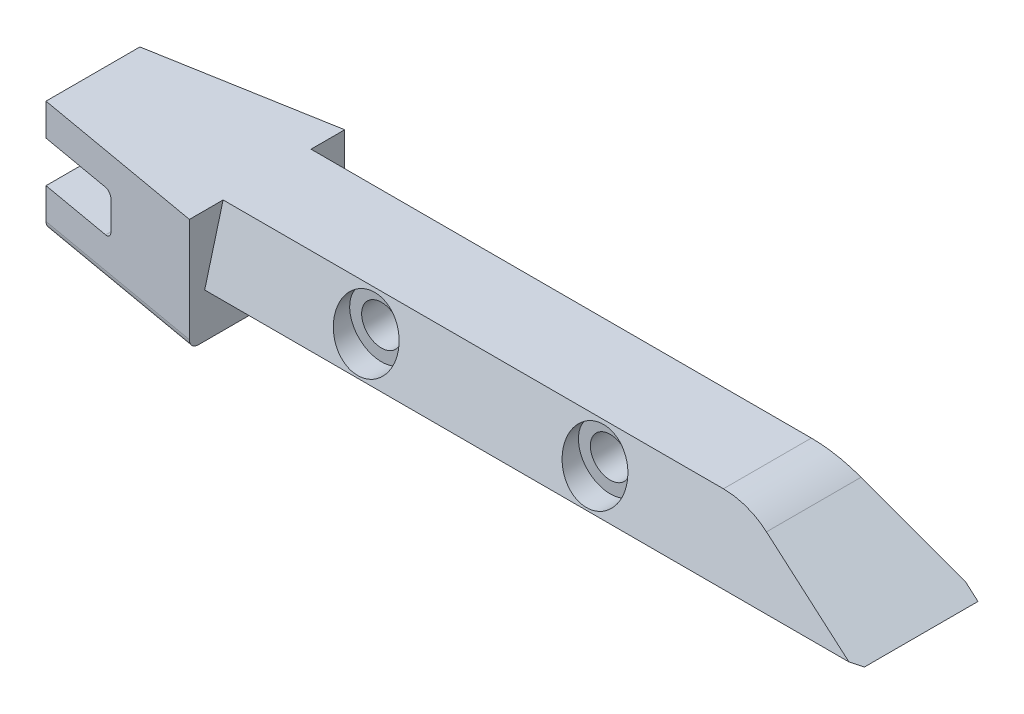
ISO-10303-21;
HEADER;
FILE_DESCRIPTION(('STEP AP214'),'2;1');
FILE_NAME('part.step','',(''),(''),'','','');
FILE_SCHEMA(('AUTOMOTIVE_DESIGN { 1 0 10303 214 1 1 1 1 }'));
ENDSEC;
DATA;
#1=APPLICATION_CONTEXT('core data for automotive mechanical design processes');
#2=APPLICATION_PROTOCOL_DEFINITION('international standard','automotive_design',2000,#1);
#3=PRODUCT_CONTEXT('',#1,'mechanical');
#4=PRODUCT('Part','Part','',(#3));
#5=PRODUCT_RELATED_PRODUCT_CATEGORY('part','',(#4));
#6=PRODUCT_DEFINITION_FORMATION('','',#4);
#7=PRODUCT_DEFINITION_CONTEXT('part definition',#1,'design');
#8=PRODUCT_DEFINITION('design','',#6,#7);
#9=PRODUCT_DEFINITION_SHAPE('','',#8);
#10=(LENGTH_UNIT() NAMED_UNIT(*) SI_UNIT(.MILLI.,.METRE.));
#11=(NAMED_UNIT(*) PLANE_ANGLE_UNIT() SI_UNIT($,.RADIAN.));
#12=(NAMED_UNIT(*) SI_UNIT($,.STERADIAN.) SOLID_ANGLE_UNIT());
#13=UNCERTAINTY_MEASURE_WITH_UNIT(LENGTH_MEASURE(1.E-05),#10,'distance_accuracy_value','');
#14=(GEOMETRIC_REPRESENTATION_CONTEXT(3) GLOBAL_UNCERTAINTY_ASSIGNED_CONTEXT((#13)) GLOBAL_UNIT_ASSIGNED_CONTEXT((#10,
#11,#12)) REPRESENTATION_CONTEXT('',''));
#15=CARTESIAN_POINT('',(0.,0.,0.));
#16=DIRECTION('',(0.,0.,1.));
#17=DIRECTION('',(1.,0.,0.));
#18=AXIS2_PLACEMENT_3D('',#15,#16,#17);
#19=CARTESIAN_POINT('',(38.1,3.81,-7.7597));
#20=DIRECTION('',(0.,0.,1.));
#21=DIRECTION('',(1.,0.,0.));
#22=AXIS2_PLACEMENT_3D('',#19,#20,#21);
#23=CYLINDRICAL_SURFACE('',#22,1.9812);
#24=CARTESIAN_POINT('',(38.1,3.81,-3.81));
#25=DIRECTION('',(0.,0.,1.));
#26=DIRECTION('',(1.,0.,0.));
#27=AXIS2_PLACEMENT_3D('',#24,#25,#26);
#28=CIRCLE('',#27,1.9812);
#29=CARTESIAN_POINT('',(40.0812,3.81,-3.81));
#30=VERTEX_POINT('',#29);
#31=EDGE_CURVE('E382',#30,#30,#28,.F.);
#32=ORIENTED_EDGE('',*,*,#31,.T.);
#33=EDGE_LOOP('',(#32));
#34=FACE_BOUND('',#33,.T.);
#35=CARTESIAN_POINT('',(38.1,3.81,3.81));
#36=DIRECTION('',(0.,0.,1.));
#37=DIRECTION('',(1.,0.,0.));
#38=AXIS2_PLACEMENT_3D('',#35,#36,#37);
#39=CIRCLE('',#38,1.9812);
#40=CARTESIAN_POINT('',(40.0812,3.81,3.81));
#41=VERTEX_POINT('',#40);
#42=EDGE_CURVE('E392',#41,#41,#39,.F.);
#43=ORIENTED_EDGE('',*,*,#42,.F.);
#44=EDGE_LOOP('',(#43));
#45=FACE_BOUND('',#44,.T.);
#46=ADVANCED_FACE('F34',(#34,#45),#23,.F.);
#47=CARTESIAN_POINT('',(15.24,3.81,-7.7597));
#48=DIRECTION('',(0.,0.,1.));
#49=DIRECTION('',(1.,0.,0.));
#50=AXIS2_PLACEMENT_3D('',#47,#48,#49);
#51=CYLINDRICAL_SURFACE('',#50,1.9812);
#52=CARTESIAN_POINT('',(15.24,3.81,-3.81));
#53=DIRECTION('',(0.,0.,1.));
#54=DIRECTION('',(1.,0.,0.));
#55=AXIS2_PLACEMENT_3D('',#52,#53,#54);
#56=CIRCLE('',#55,1.9812);
#57=CARTESIAN_POINT('',(17.2212,3.81,-3.81));
#58=VERTEX_POINT('',#57);
#59=EDGE_CURVE('E379',#58,#58,#56,.F.);
#60=ORIENTED_EDGE('',*,*,#59,.T.);
#61=EDGE_LOOP('',(#60));
#62=FACE_BOUND('',#61,.T.);
#63=CARTESIAN_POINT('',(15.24,3.81,3.81));
#64=DIRECTION('',(0.,0.,1.));
#65=DIRECTION('',(1.,0.,0.));
#66=AXIS2_PLACEMENT_3D('',#63,#64,#65);
#67=CIRCLE('',#66,1.9812);
#68=CARTESIAN_POINT('',(17.2212,3.81,3.81));
#69=VERTEX_POINT('',#68);
#70=EDGE_CURVE('E389',#69,#69,#67,.F.);
#71=ORIENTED_EDGE('',*,*,#70,.F.);
#72=EDGE_LOOP('',(#71));
#73=FACE_BOUND('',#72,.T.);
#74=ADVANCED_FACE('F513',(#62,#73),#51,.F.);
#75=CARTESIAN_POINT('',(-17.399,-3.9878,4.6917868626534));
#76=DIRECTION('',(-1.,0.,0.));
#77=DIRECTION('',(0.,0.,1.));
#78=AXIS2_PLACEMENT_3D('',#75,#76,#77);
#79=PLANE('',#78);
#80=DIRECTION('',(0.,0.,-1.));
#81=VECTOR('',#80,1.);
#82=CARTESIAN_POINT('',(-17.399,4.1148,4.6917868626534));
#83=LINE('',#82,#81);
#84=CARTESIAN_POINT('',(-17.399,4.1148,4.6917868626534));
#85=VERTEX_POINT('',#84);
#86=CARTESIAN_POINT('',(-17.399,4.1148,-4.6917868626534));
#87=VERTEX_POINT('',#86);
#88=EDGE_CURVE('E370',#85,#87,#83,.T.);
#89=ORIENTED_EDGE('',*,*,#88,.F.);
#90=DIRECTION('',(0.,1.,0.));
#91=VECTOR('',#90,1.);
#92=CARTESIAN_POINT('',(-17.399,-3.9878,4.6917868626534));
#93=LINE('',#92,#91);
#94=CARTESIAN_POINT('',(-17.399,7.3152,4.6917868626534));
#95=VERTEX_POINT('',#94);
#96=EDGE_CURVE('E301',#85,#95,#93,.T.);
#97=ORIENTED_EDGE('',*,*,#96,.T.);
#98=DIRECTION('',(0.,0.,1.));
#99=VECTOR('',#98,1.);
#100=CARTESIAN_POINT('',(-17.399,7.3152,4.6917868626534));
#101=LINE('',#100,#99);
#102=CARTESIAN_POINT('',(-17.399,7.3152,-4.6917868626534));
#103=VERTEX_POINT('',#102);
#104=EDGE_CURVE('E428',#103,#95,#101,.T.);
#105=ORIENTED_EDGE('',*,*,#104,.F.);
#106=DIRECTION('',(0.,1.,0.));
#107=VECTOR('',#106,1.);
#108=CARTESIAN_POINT('',(-17.399,-3.9878,-4.6917868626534));
#109=LINE('',#108,#107);
#110=EDGE_CURVE('E284',#87,#103,#109,.T.);
#111=ORIENTED_EDGE('',*,*,#110,.F.);
#112=EDGE_LOOP('',(#89,#97,#105,#111));
#113=FACE_BOUND('',#112,.T.);
#114=ADVANCED_FACE('F519',(#113),#79,.T.);
#115=CARTESIAN_POINT('',(65.151,0.,6.35213681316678));
#116=DIRECTION('',(0.,1.,0.));
#117=DIRECTION('',(0.,0.,1.));
#118=AXIS2_PLACEMENT_3D('',#115,#116,#117);
#119=PLANE('',#118);
#120=DIRECTION('',(-1.,0.,0.));
#121=VECTOR('',#120,1.);
#122=CARTESIAN_POINT('',(65.151,0.,5.46313681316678));
#123=LINE('',#122,#121);
#124=CARTESIAN_POINT('',(65.151,0.,5.46313681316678));
#125=VERTEX_POINT('',#124);
#126=CARTESIAN_POINT('',(0.254000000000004,0.,5.46313681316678));
#127=VERTEX_POINT('',#126);
#128=EDGE_CURVE('E346',#125,#127,#123,.T.);
#129=ORIENTED_EDGE('',*,*,#128,.T.);
#130=DIRECTION('',(0.,0.,-1.));
#131=VECTOR('',#130,1.);
#132=CARTESIAN_POINT('',(0.254000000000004,0.,6.35213681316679));
#133=LINE('',#132,#131);
#134=CARTESIAN_POINT('',(0.254000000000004,0.,-5.89195655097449));
#135=VERTEX_POINT('',#134);
#136=EDGE_CURVE('E357',#127,#135,#133,.T.);
#137=ORIENTED_EDGE('',*,*,#136,.T.);
#138=DIRECTION('',(1.,0.,0.));
#139=VECTOR('',#138,1.);
#140=CARTESIAN_POINT('',(65.151,0.,-5.89195655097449));
#141=LINE('',#140,#139);
#142=CARTESIAN_POINT('',(65.151,0.,-5.89195655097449));
#143=VERTEX_POINT('',#142);
#144=EDGE_CURVE('E349',#135,#143,#141,.T.);
#145=ORIENTED_EDGE('',*,*,#144,.T.);
#146=DIRECTION('',(0.,0.,-1.));
#147=VECTOR('',#146,1.);
#148=CARTESIAN_POINT('',(65.151,0.,6.35213681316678));
#149=LINE('',#148,#147);
#150=EDGE_CURVE('E320',#125,#143,#149,.T.);
#151=ORIENTED_EDGE('',*,*,#150,.F.);
#152=EDGE_LOOP('',(#129,#137,#145,#151));
#153=FACE_BOUND('',#152,.T.);
#154=ADVANCED_FACE('F555',(#153),#119,.F.);
#155=CARTESIAN_POINT('',(65.151,0.,-6.35213681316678));
#156=DIRECTION('',(0.,-0.258819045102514,0.96592582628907));
#157=DIRECTION('',(0.,-0.96592582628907,-0.258819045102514));
#158=AXIS2_PLACEMENT_3D('',#155,#156,#157);
#159=PLANE('',#158);
#160=DIRECTION('',(-1.,0.,0.));
#161=VECTOR('',#160,1.);
#162=CARTESIAN_POINT('',(65.151,0.858708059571,-6.12204668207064));
#163=LINE('',#162,#161);
#164=CARTESIAN_POINT('',(36.929316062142,0.858708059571,-6.12204668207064));
#165=VERTEX_POINT('',#164);
#166=CARTESIAN_POINT('',(16.4106839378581,0.858708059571,-6.12204668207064));
#167=VERTEX_POINT('',#166);
#168=EDGE_CURVE('E342',#165,#167,#163,.T.);
#169=ORIENTED_EDGE('',*,*,#168,.T.);
#170=CARTESIAN_POINT('',(15.24,3.81,-5.33125039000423));
#171=DIRECTION('',(0.,-0.258819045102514,0.96592582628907));
#172=DIRECTION('',(0.,0.96592582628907,0.258819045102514));
#173=AXIS2_PLACEMENT_3D('',#170,#171,#172);
#174=ELLIPSE('',#173,3.28700187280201,3.175);
#175=CARTESIAN_POINT('',(14.069316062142,0.858708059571,-6.12204668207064));
#176=VERTEX_POINT('',#175);
#177=EDGE_CURVE('E446',#167,#176,#174,.T.);
#178=ORIENTED_EDGE('',*,*,#177,.T.);
#179=CARTESIAN_POINT('',(0.,0.858708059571,-6.12204668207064));
#180=VERTEX_POINT('',#179);
#181=EDGE_CURVE('E337',#176,#180,#163,.T.);
#182=ORIENTED_EDGE('',*,*,#181,.T.);
#183=DIRECTION('',(0.,0.96592582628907,0.258819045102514));
#184=VECTOR('',#183,1.);
#185=CARTESIAN_POINT('',(0.,0.,-6.35213681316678));
#186=LINE('',#185,#184);
#187=CARTESIAN_POINT('',(0.,7.3152,-4.39203488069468));
#188=VERTEX_POINT('',#187);
#189=EDGE_CURVE('E319',#180,#188,#186,.T.);
#190=ORIENTED_EDGE('',*,*,#189,.T.);
#191=DIRECTION('',(-1.,0.,0.));
#192=VECTOR('',#191,1.);
#193=CARTESIAN_POINT('',(65.151,7.3152,-4.39203488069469));
#194=LINE('',#193,#192);
#195=CARTESIAN_POINT('',(49.9965449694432,7.3152,-4.39203488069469));
#196=VERTEX_POINT('',#195);
#197=EDGE_CURVE('E331',#196,#188,#194,.T.);
#198=ORIENTED_EDGE('',*,*,#197,.F.);
#199=CARTESIAN_POINT('',(49.9965449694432,-1.9558,-6.87619184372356));
#200=DIRECTION('',(0.,-0.258819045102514,0.96592582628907));
#201=DIRECTION('',(0.,0.96592582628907,0.258819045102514));
#202=AXIS2_PLACEMENT_3D('',#199,#200,#201);
#203=ELLIPSE('',#202,9.59804546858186,9.271);
#204=CARTESIAN_POINT('',(54.6320449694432,6.07312151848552,-4.72484880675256));
#205=VERTEX_POINT('',#204);
#206=EDGE_CURVE('E316',#196,#205,#203,.F.);
#207=ORIENTED_EDGE('',*,*,#206,.T.);
#208=DIRECTION('',(0.858356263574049,-0.495572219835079,-0.132788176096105));
#209=VECTOR('',#208,1.);
#210=CARTESIAN_POINT('',(65.151,0.,-6.35213681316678));
#211=LINE('',#210,#209);
#212=CARTESIAN_POINT('',(63.6636740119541,0.858708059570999,-6.12204668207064));
#213=VERTEX_POINT('',#212);
#214=EDGE_CURVE('E313',#205,#213,#211,.T.);
#215=ORIENTED_EDGE('',*,*,#214,.T.);
#216=CARTESIAN_POINT('',(39.270683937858,0.858708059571,-6.12204668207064));
#217=VERTEX_POINT('',#216);
#218=EDGE_CURVE('E338',#213,#217,#163,.T.);
#219=ORIENTED_EDGE('',*,*,#218,.T.);
#220=CARTESIAN_POINT('',(38.1,3.81,-5.33125039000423));
#221=DIRECTION('',(0.,-0.258819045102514,0.96592582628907));
#222=DIRECTION('',(0.,0.96592582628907,0.258819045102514));
#223=AXIS2_PLACEMENT_3D('',#220,#221,#222);
#224=ELLIPSE('',#223,3.287001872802,3.175);
#225=EDGE_CURVE('E386',#217,#165,#224,.T.);
#226=ORIENTED_EDGE('',*,*,#225,.T.);
#227=EDGE_LOOP('',(#169,#178,#182,#190,#198,#207,#215,#219,#226));
#228=FACE_BOUND('',#227,.T.);
#229=ADVANCED_FACE('F443',(#228),#159,.F.);
#230=CARTESIAN_POINT('',(65.151,7.3152,4.39203488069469));
#231=DIRECTION('',(0.,-1.,0.));
#232=DIRECTION('',(0.,0.,-1.));
#233=AXIS2_PLACEMENT_3D('',#230,#231,#232);
#234=PLANE('',#233);
#235=ORIENTED_EDGE('',*,*,#197,.T.);
#236=DIRECTION('',(0.,0.,-1.));
#237=VECTOR('',#236,1.);
#238=CARTESIAN_POINT('',(0.,7.3152,7.7597));
#239=LINE('',#238,#237);
#240=CARTESIAN_POINT('',(0.,7.3152,-7.7597));
#241=VERTEX_POINT('',#240);
#242=EDGE_CURVE('E421',#188,#241,#239,.T.);
#243=ORIENTED_EDGE('',*,*,#242,.T.);
#244=DIRECTION('',(-0.984807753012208,0.,0.173648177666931));
#245=VECTOR('',#244,1.);
#246=CARTESIAN_POINT('',(0.,7.3152,-7.7597));
#247=LINE('',#246,#245);
#248=EDGE_CURVE('E278',#241,#103,#247,.T.);
#249=ORIENTED_EDGE('',*,*,#248,.T.);
#250=ORIENTED_EDGE('',*,*,#104,.T.);
#251=DIRECTION('',(0.984807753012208,0.,0.173648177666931));
#252=VECTOR('',#251,1.);
#253=CARTESIAN_POINT('',(0.,7.3152,7.7597));
#254=LINE('',#253,#252);
#255=CARTESIAN_POINT('',(0.,7.3152,7.7597));
#256=VERTEX_POINT('',#255);
#257=EDGE_CURVE('E431',#95,#256,#254,.T.);
#258=ORIENTED_EDGE('',*,*,#257,.T.);
#259=CARTESIAN_POINT('',(0.,7.3152,4.39203488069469));
#260=VERTEX_POINT('',#259);
#261=EDGE_CURVE('E418',#256,#260,#239,.T.);
#262=ORIENTED_EDGE('',*,*,#261,.T.);
#263=DIRECTION('',(-1.,0.,0.));
#264=VECTOR('',#263,1.);
#265=CARTESIAN_POINT('',(65.151,7.3152,4.39203488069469));
#266=LINE('',#265,#264);
#267=CARTESIAN_POINT('',(49.9965449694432,7.3152,4.39203488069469));
#268=VERTEX_POINT('',#267);
#269=EDGE_CURVE('E323',#268,#260,#266,.T.);
#270=ORIENTED_EDGE('',*,*,#269,.F.);
#271=DIRECTION('',(0.,0.,1.));
#272=VECTOR('',#271,1.);
#273=CARTESIAN_POINT('',(49.9965449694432,7.3152,-6.35213681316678));
#274=LINE('',#273,#272);
#275=EDGE_CURVE('E279',#196,#268,#274,.T.);
#276=ORIENTED_EDGE('',*,*,#275,.F.);
#277=EDGE_LOOP('',(#235,#243,#249,#250,#258,#262,#270,#276));
#278=FACE_BOUND('',#277,.T.);
#279=ADVANCED_FACE('F436',(#278),#234,.F.);
#280=CARTESIAN_POINT('',(65.151,0.,6.35213681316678));
#281=DIRECTION('',(0.,-0.258819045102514,-0.96592582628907));
#282=DIRECTION('',(0.,0.96592582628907,-0.258819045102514));
#283=AXIS2_PLACEMENT_3D('',#280,#281,#282);
#284=PLANE('',#283);
#285=CARTESIAN_POINT('',(15.24,3.81,5.33125039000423));
#286=DIRECTION('',(0.,-0.258819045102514,-0.96592582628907));
#287=DIRECTION('',(0.,0.96592582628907,-0.258819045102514));
#288=AXIS2_PLACEMENT_3D('',#285,#286,#287);
#289=ELLIPSE('',#288,3.28700187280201,3.175);
#290=CARTESIAN_POINT('',(15.24,6.985,4.48051170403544));
#291=VERTEX_POINT('',#290);
#292=EDGE_CURVE('E399',#291,#291,#289,.F.);
#293=ORIENTED_EDGE('',*,*,#292,.F.);
#294=EDGE_LOOP('',(#293));
#295=FACE_BOUND('',#294,.T.);
#296=CARTESIAN_POINT('',(38.1,3.81,5.33125039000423));
#297=DIRECTION('',(0.,-0.258819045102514,-0.96592582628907));
#298=DIRECTION('',(0.,0.96592582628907,-0.258819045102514));
#299=AXIS2_PLACEMENT_3D('',#296,#297,#298);
#300=ELLIPSE('',#299,3.287001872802,3.175);
#301=CARTESIAN_POINT('',(38.1,6.985,4.48051170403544));
#302=VERTEX_POINT('',#301);
#303=EDGE_CURVE('E396',#302,#302,#300,.F.);
#304=ORIENTED_EDGE('',*,*,#303,.F.);
#305=EDGE_LOOP('',(#304));
#306=FACE_BOUND('',#305,.T.);
#307=DIRECTION('',(0.,-0.96592582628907,0.258819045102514));
#308=VECTOR('',#307,1.);
#309=CARTESIAN_POINT('',(0.,0.,6.35213681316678));
#310=LINE('',#309,#308);
#311=CARTESIAN_POINT('',(0.,0.4445,6.23303339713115));
#312=VERTEX_POINT('',#311);
#313=EDGE_CURVE('E324',#260,#312,#310,.T.);
#314=ORIENTED_EDGE('',*,*,#313,.T.);
#315=DIRECTION('',(1.,0.,0.));
#316=VECTOR('',#315,1.);
#317=CARTESIAN_POINT('',(65.151,0.4445,6.23303339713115));
#318=LINE('',#317,#316);
#319=CARTESIAN_POINT('',(64.3811034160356,0.444500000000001,6.23303339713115));
#320=VERTEX_POINT('',#319);
#321=EDGE_CURVE('E355',#312,#320,#318,.T.);
#322=ORIENTED_EDGE('',*,*,#321,.T.);
#323=DIRECTION('',(-0.858356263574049,0.495572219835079,-0.132788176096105));
#324=VECTOR('',#323,1.);
#325=CARTESIAN_POINT('',(65.151,0.,6.35213681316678));
#326=LINE('',#325,#324);
#327=CARTESIAN_POINT('',(54.6320449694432,6.07312151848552,4.72484880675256));
#328=VERTEX_POINT('',#327);
#329=EDGE_CURVE('E310',#320,#328,#326,.T.);
#330=ORIENTED_EDGE('',*,*,#329,.T.);
#331=CARTESIAN_POINT('',(49.9965449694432,-1.9558,6.87619184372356));
#332=DIRECTION('',(0.,-0.258819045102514,-0.96592582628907));
#333=DIRECTION('',(0.,-0.96592582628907,0.258819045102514));
#334=AXIS2_PLACEMENT_3D('',#331,#332,#333);
#335=ELLIPSE('',#334,9.59804546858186,9.271);
#336=EDGE_CURVE('E334',#328,#268,#335,.F.);
#337=ORIENTED_EDGE('',*,*,#336,.T.);
#338=ORIENTED_EDGE('',*,*,#269,.T.);
#339=EDGE_LOOP('',(#314,#322,#330,#337,#338));
#340=FACE_BOUND('',#339,.T.);
#341=ADVANCED_FACE('F625',(#295,#306,#340),#284,.F.);
#342=CARTESIAN_POINT('',(49.9965449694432,-1.9558,-6.35213681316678));
#343=DIRECTION('',(0.,0.,1.));
#344=DIRECTION('',(1.,0.,0.));
#345=AXIS2_PLACEMENT_3D('',#342,#343,#344);
#346=CYLINDRICAL_SURFACE('',#345,9.271);
#347=ORIENTED_EDGE('',*,*,#275,.T.);
#348=ORIENTED_EDGE('',*,*,#336,.F.);
#349=DIRECTION('',(0.,0.,1.));
#350=VECTOR('',#349,1.);
#351=CARTESIAN_POINT('',(54.6320449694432,6.07312151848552,-6.35213681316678));
#352=LINE('',#351,#350);
#353=EDGE_CURVE('E307',#205,#328,#352,.T.);
#354=ORIENTED_EDGE('',*,*,#353,.F.);
#355=ORIENTED_EDGE('',*,*,#206,.F.);
#356=EDGE_LOOP('',(#347,#348,#354,#355));
#357=FACE_BOUND('',#356,.T.);
#358=ADVANCED_FACE('F630',(#357),#346,.T.);
#359=CARTESIAN_POINT('',(65.151,0.,-6.35213681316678));
#360=DIRECTION('',(-0.5,-0.866025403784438,0.));
#361=DIRECTION('',(0.866025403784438,-0.5,0.));
#362=AXIS2_PLACEMENT_3D('',#359,#360,#361);
#363=PLANE('',#362);
#364=ORIENTED_EDGE('',*,*,#150,.T.);
#365=DIRECTION('',(0.858356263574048,-0.495572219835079,0.132788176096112));
#366=VECTOR('',#365,1.);
#367=CARTESIAN_POINT('',(64.7594993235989,0.226033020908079,-5.95252191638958));
#368=LINE('',#367,#366);
#369=EDGE_CURVE('E353',#143,#213,#368,.F.);
#370=ORIENTED_EDGE('',*,*,#369,.T.);
#371=ORIENTED_EDGE('',*,*,#214,.F.);
#372=ORIENTED_EDGE('',*,*,#353,.T.);
#373=ORIENTED_EDGE('',*,*,#329,.F.);
#374=DIRECTION('',(-0.654653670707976,0.377964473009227,0.654653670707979));
#375=VECTOR('',#374,1.);
#376=CARTESIAN_POINT('',(65.151,0.,5.46313681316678));
#377=LINE('',#376,#375);
#378=EDGE_CURVE('E351',#320,#125,#377,.F.);
#379=ORIENTED_EDGE('',*,*,#378,.T.);
#380=EDGE_LOOP('',(#364,#370,#371,#372,#373,#379));
#381=FACE_BOUND('',#380,.T.);
#382=ADVANCED_FACE('F569',(#381),#363,.F.);
#383=CARTESIAN_POINT('',(65.151,0.858708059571,-6.12204668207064));
#384=DIRECTION('',(0.,0.258819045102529,0.965925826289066));
#385=DIRECTION('',(-1.,0.,0.));
#386=AXIS2_PLACEMENT_3D('',#383,#384,#385);
#387=PLANE('',#386);
#388=CARTESIAN_POINT('',(15.24,3.81,-6.9128429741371));
#389=DIRECTION('',(0.,0.258819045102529,0.965925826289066));
#390=DIRECTION('',(0.,-0.965925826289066,0.258819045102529));
#391=AXIS2_PLACEMENT_3D('',#388,#389,#390);
#392=ELLIPSE('',#391,3.28700187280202,3.175);
#393=EDGE_CURVE('E224',#167,#176,#392,.F.);
#394=ORIENTED_EDGE('',*,*,#393,.F.);
#395=ORIENTED_EDGE('',*,*,#168,.F.);
#396=CARTESIAN_POINT('',(38.1,3.81,-6.9128429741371));
#397=DIRECTION('',(0.,0.258819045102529,0.965925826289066));
#398=DIRECTION('',(0.,-0.965925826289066,0.258819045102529));
#399=AXIS2_PLACEMENT_3D('',#396,#397,#398);
#400=ELLIPSE('',#399,3.28700187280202,3.175);
#401=EDGE_CURVE('E378',#217,#165,#400,.F.);
#402=ORIENTED_EDGE('',*,*,#401,.F.);
#403=ORIENTED_EDGE('',*,*,#218,.F.);
#404=ORIENTED_EDGE('',*,*,#369,.F.);
#405=ORIENTED_EDGE('',*,*,#144,.F.);
#406=CARTESIAN_POINT('',(0.254000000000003,-0.254000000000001,-5.82389745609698));
#407=DIRECTION('',(0.,0.258819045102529,0.965925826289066));
#408=DIRECTION('',(0.,0.965925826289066,-0.258819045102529));
#409=AXIS2_PLACEMENT_3D('',#406,#407,#408);
#410=ELLIPSE('',#409,0.262960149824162,0.254);
#411=CARTESIAN_POINT('',(0.,-0.254000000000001,-5.82389745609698));
#412=VERTEX_POINT('',#411);
#413=EDGE_CURVE('E363',#135,#412,#410,.T.);
#414=ORIENTED_EDGE('',*,*,#413,.T.);
#415=DIRECTION('',(0.,0.965925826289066,-0.258819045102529));
#416=VECTOR('',#415,1.);
#417=CARTESIAN_POINT('',(0.,0.858708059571,-6.12204668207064));
#418=LINE('',#417,#416);
#419=EDGE_CURVE('E344',#180,#412,#418,.F.);
#420=ORIENTED_EDGE('',*,*,#419,.F.);
#421=ORIENTED_EDGE('',*,*,#181,.F.);
#422=EDGE_LOOP('',(#394,#395,#402,#403,#404,#405,#414,#420,#421));
#423=FACE_BOUND('',#422,.T.);
#424=ADVANCED_FACE('F452',(#423),#387,.F.);
#425=CARTESIAN_POINT('',(65.151,0.,5.46313681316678));
#426=DIRECTION('',(0.,0.866025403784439,-0.499999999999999));
#427=DIRECTION('',(-1.,0.,0.));
#428=AXIS2_PLACEMENT_3D('',#425,#426,#427);
#429=PLANE('',#428);
#430=ORIENTED_EDGE('',*,*,#378,.F.);
#431=ORIENTED_EDGE('',*,*,#321,.F.);
#432=DIRECTION('',(0.,-0.499999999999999,-0.866025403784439));
#433=VECTOR('',#432,1.);
#434=CARTESIAN_POINT('',(0.,0.,5.46313681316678));
#435=LINE('',#434,#433);
#436=CARTESIAN_POINT('',(0.,-0.254000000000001,5.02319590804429));
#437=VERTEX_POINT('',#436);
#438=EDGE_CURVE('E341',#437,#312,#435,.F.);
#439=ORIENTED_EDGE('',*,*,#438,.F.);
#440=CARTESIAN_POINT('',(0.254000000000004,-0.254000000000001,5.02319590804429));
#441=DIRECTION('',(0.,0.866025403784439,-0.499999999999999));
#442=DIRECTION('',(0.,-0.499999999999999,-0.866025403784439));
#443=AXIS2_PLACEMENT_3D('',#440,#441,#442);
#444=ELLIPSE('',#443,0.508000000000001,0.254);
#445=EDGE_CURVE('E366',#437,#127,#444,.T.);
#446=ORIENTED_EDGE('',*,*,#445,.T.);
#447=ORIENTED_EDGE('',*,*,#128,.F.);
#448=EDGE_LOOP('',(#430,#431,#439,#446,#447));
#449=FACE_BOUND('',#448,.T.);
#450=ADVANCED_FACE('F568',(#449),#429,.F.);
#451=CARTESIAN_POINT('',(0.,-3.9878,7.7597));
#452=DIRECTION('',(1.,0.,0.));
#453=DIRECTION('',(0.,0.,-1.));
#454=AXIS2_PLACEMENT_3D('',#451,#452,#453);
#455=PLANE('',#454);
#456=DIRECTION('',(0.,0.,-1.));
#457=VECTOR('',#456,1.);
#458=CARTESIAN_POINT('',(0.,-3.9878,7.7597));
#459=LINE('',#458,#457);
#460=CARTESIAN_POINT('',(0.,-3.9878,6.85698574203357));
#461=VERTEX_POINT('',#460);
#462=CARTESIAN_POINT('',(0.,-3.9878,-6.85698574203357));
#463=VERTEX_POINT('',#462);
#464=EDGE_CURVE('E270',#461,#463,#459,.T.);
#465=ORIENTED_EDGE('',*,*,#464,.T.);
#466=CARTESIAN_POINT('',(0.,-3.0988,-6.85698574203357));
#467=DIRECTION('',(1.,0.,0.));
#468=DIRECTION('',(0.,0.,1.));
#469=AXIS2_PLACEMENT_3D('',#466,#467,#468);
#470=ELLIPSE('',#469,0.902714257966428,0.889);
#471=CARTESIAN_POINT('',(0.,-3.0988,-7.7597));
#472=VERTEX_POINT('',#471);
#473=EDGE_CURVE('E42',#463,#472,#470,.T.);
#474=ORIENTED_EDGE('',*,*,#473,.T.);
#475=DIRECTION('',(0.,1.,0.));
#476=VECTOR('',#475,1.);
#477=CARTESIAN_POINT('',(0.,-3.9878,-7.7597));
#478=LINE('',#477,#476);
#479=EDGE_CURVE('E267',#472,#241,#478,.T.);
#480=ORIENTED_EDGE('',*,*,#479,.T.);
#481=ORIENTED_EDGE('',*,*,#242,.F.);
#482=ORIENTED_EDGE('',*,*,#189,.F.);
#483=ORIENTED_EDGE('',*,*,#419,.T.);
#484=DIRECTION('',(0.,0.,-1.));
#485=VECTOR('',#484,1.);
#486=CARTESIAN_POINT('',(0.,-0.254000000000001,7.7597));
#487=LINE('',#486,#485);
#488=EDGE_CURVE('E360',#412,#437,#487,.F.);
#489=ORIENTED_EDGE('',*,*,#488,.T.);
#490=ORIENTED_EDGE('',*,*,#438,.T.);
#491=ORIENTED_EDGE('',*,*,#313,.F.);
#492=ORIENTED_EDGE('',*,*,#261,.F.);
#493=DIRECTION('',(0.,1.,0.));
#494=VECTOR('',#493,1.);
#495=CARTESIAN_POINT('',(0.,-3.9878,7.7597));
#496=LINE('',#495,#494);
#497=CARTESIAN_POINT('',(0.,-3.0988,7.7597));
#498=VERTEX_POINT('',#497);
#499=EDGE_CURVE('E280',#498,#256,#496,.T.);
#500=ORIENTED_EDGE('',*,*,#499,.F.);
#501=CARTESIAN_POINT('',(0.,-3.0988,6.85698574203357));
#502=DIRECTION('',(1.,0.,0.));
#503=DIRECTION('',(0.,0.,1.));
#504=AXIS2_PLACEMENT_3D('',#501,#502,#503);
#505=ELLIPSE('',#504,0.902714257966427,0.889);
#506=EDGE_CURVE('E49',#498,#461,#505,.T.);
#507=ORIENTED_EDGE('',*,*,#506,.T.);
#508=EDGE_LOOP('',(#465,#474,#480,#481,#482,#483,#489,#490,#491,#492,#500,#507));
#509=FACE_BOUND('',#508,.T.);
#510=ADVANCED_FACE('F266',(#509),#455,.T.);
#511=CARTESIAN_POINT('',(0.,-3.9878,-7.7597));
#512=DIRECTION('',(-0.173648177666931,0.,-0.984807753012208));
#513=DIRECTION('',(-0.984807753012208,0.,0.173648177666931));
#514=AXIS2_PLACEMENT_3D('',#511,#512,#513);
#515=PLANE('',#514);
#516=DIRECTION('',(0.701673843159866,0.701673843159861,-0.123724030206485));
#517=VECTOR('',#516,1.);
#518=CARTESIAN_POINT('',(-12.8756371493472,-2.63943714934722,-5.48937777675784));
#519=LINE('',#518,#517);
#520=CARTESIAN_POINT('',(-12.6492,-2.413,-5.52930475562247));
#521=VERTEX_POINT('',#520);
#522=CARTESIAN_POINT('',(-13.335,-3.0988,-5.4083797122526));
#523=VERTEX_POINT('',#522);
#524=EDGE_CURVE('E241',#521,#523,#519,.F.);
#525=ORIENTED_EDGE('',*,*,#524,.T.);
#526=DIRECTION('',(-0.984807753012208,0.,0.173648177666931));
#527=VECTOR('',#526,1.);
#528=CARTESIAN_POINT('',(0.,-3.0988,-7.7597));
#529=LINE('',#528,#527);
#530=CARTESIAN_POINT('',(-17.399,-3.0988,-4.6917868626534));
#531=VERTEX_POINT('',#530);
#532=EDGE_CURVE('E247',#523,#531,#529,.T.);
#533=ORIENTED_EDGE('',*,*,#532,.T.);
#534=CARTESIAN_POINT('',(-17.399,0.,-4.6917868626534));
#535=VERTEX_POINT('',#534);
#536=EDGE_CURVE('E304',#531,#535,#109,.T.);
#537=ORIENTED_EDGE('',*,*,#536,.T.);
#538=DIRECTION('',(-0.984807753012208,0.,0.173648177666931));
#539=VECTOR('',#538,1.);
#540=CARTESIAN_POINT('',(0.,0.,-7.7597));
#541=LINE('',#540,#539);
#542=CARTESIAN_POINT('',(-10.16,0.,-5.96821787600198));
#543=VERTEX_POINT('',#542);
#544=EDGE_CURVE('E473',#543,#535,#541,.T.);
#545=ORIENTED_EDGE('',*,*,#544,.F.);
#546=CARTESIAN_POINT('',(-10.16,0.634999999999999,-5.96821787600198));
#547=DIRECTION('',(-0.173648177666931,0.,-0.984807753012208));
#548=DIRECTION('',(-0.984807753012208,0.,0.173648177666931));
#549=AXIS2_PLACEMENT_3D('',#546,#547,#548);
#550=ELLIPSE('',#549,0.644795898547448,0.635);
#551=CARTESIAN_POINT('',(-9.525,0.635000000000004,-6.08018550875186));
#552=VERTEX_POINT('',#551);
#553=EDGE_CURVE('E480',#552,#543,#550,.T.);
#554=ORIENTED_EDGE('',*,*,#553,.F.);
#555=DIRECTION('',(0.,-1.,0.));
#556=VECTOR('',#555,1.);
#557=CARTESIAN_POINT('',(-9.525,-3.9878,-6.08018550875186));
#558=LINE('',#557,#556);
#559=CARTESIAN_POINT('',(-9.525,3.47979999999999,-6.08018550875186));
#560=VERTEX_POINT('',#559);
#561=EDGE_CURVE('E481',#560,#552,#558,.T.);
#562=ORIENTED_EDGE('',*,*,#561,.F.);
#563=CARTESIAN_POINT('',(-10.16,3.4798,-5.96821787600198));
#564=DIRECTION('',(-0.173648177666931,0.,-0.984807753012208));
#565=DIRECTION('',(-0.984807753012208,0.,0.173648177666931));
#566=AXIS2_PLACEMENT_3D('',#563,#564,#565);
#567=ELLIPSE('',#566,0.644795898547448,0.635);
#568=CARTESIAN_POINT('',(-10.16,4.1148,-5.96821787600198));
#569=VERTEX_POINT('',#568);
#570=EDGE_CURVE('E424',#569,#560,#567,.T.);
#571=ORIENTED_EDGE('',*,*,#570,.F.);
#572=DIRECTION('',(0.984807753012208,0.,-0.173648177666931));
#573=VECTOR('',#572,1.);
#574=CARTESIAN_POINT('',(0.,4.1148,-7.7597));
#575=LINE('',#574,#573);
#576=EDGE_CURVE('E478',#87,#569,#575,.T.);
#577=ORIENTED_EDGE('',*,*,#576,.F.);
#578=ORIENTED_EDGE('',*,*,#110,.T.);
#579=ORIENTED_EDGE('',*,*,#248,.F.);
#580=ORIENTED_EDGE('',*,*,#479,.F.);
#581=DIRECTION('',(-0.984807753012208,0.,0.173648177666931));
#582=VECTOR('',#581,1.);
#583=CARTESIAN_POINT('',(0.,-3.0988,-7.7597));
#584=LINE('',#583,#582);
#585=CARTESIAN_POINT('',(-8.76299999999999,-3.0988,-6.21454666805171));
#586=VERTEX_POINT('',#585);
#587=EDGE_CURVE('E244',#472,#586,#584,.T.);
#588=ORIENTED_EDGE('',*,*,#587,.T.);
#589=DIRECTION('',(0.701673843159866,-0.701673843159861,-0.123724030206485));
#590=VECTOR('',#589,1.);
#591=CARTESIAN_POINT('',(-9.72422770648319,-2.13757229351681,-6.04505628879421));
#592=LINE('',#591,#590);
#593=CARTESIAN_POINT('',(-9.44879999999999,-2.413,-6.09362162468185));
#594=VERTEX_POINT('',#593);
#595=EDGE_CURVE('E409',#586,#594,#592,.F.);
#596=ORIENTED_EDGE('',*,*,#595,.T.);
#597=DIRECTION('',(0.984807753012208,0.,-0.173648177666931));
#598=VECTOR('',#597,1.);
#599=CARTESIAN_POINT('',(0.,-2.413,-7.7597));
#600=LINE('',#599,#598);
#601=EDGE_CURVE('E223',#521,#594,#600,.T.);
#602=ORIENTED_EDGE('',*,*,#601,.F.);
#603=EDGE_LOOP('',(#525,#533,#537,#545,#554,#562,#571,#577,#578,#579,#580,#588,#596,#602));
#604=FACE_BOUND('',#603,.T.);
#605=ADVANCED_FACE('F276',(#604),#515,.T.);
#606=CARTESIAN_POINT('',(0.,-3.9878,7.7597));
#607=DIRECTION('',(-0.173648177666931,0.,0.984807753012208));
#608=DIRECTION('',(0.984807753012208,0.,0.173648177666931));
#609=AXIS2_PLACEMENT_3D('',#606,#607,#608);
#610=PLANE('',#609);
#611=CARTESIAN_POINT('',(-17.399,-3.0988,4.6917868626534));
#612=VERTEX_POINT('',#611);
#613=CARTESIAN_POINT('',(-17.399,0.,4.6917868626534));
#614=VERTEX_POINT('',#613);
#615=EDGE_CURVE('E293',#612,#614,#93,.T.);
#616=ORIENTED_EDGE('',*,*,#615,.F.);
#617=DIRECTION('',(0.984807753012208,0.,0.173648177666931));
#618=VECTOR('',#617,1.);
#619=CARTESIAN_POINT('',(0.,-3.0988,7.7597));
#620=LINE('',#619,#618);
#621=EDGE_CURVE('E11',#612,#498,#620,.T.);
#622=ORIENTED_EDGE('',*,*,#621,.T.);
#623=ORIENTED_EDGE('',*,*,#499,.T.);
#624=ORIENTED_EDGE('',*,*,#257,.F.);
#625=ORIENTED_EDGE('',*,*,#96,.F.);
#626=DIRECTION('',(-0.984807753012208,0.,-0.173648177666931));
#627=VECTOR('',#626,1.);
#628=CARTESIAN_POINT('',(0.,4.1148,7.7597));
#629=LINE('',#628,#627);
#630=CARTESIAN_POINT('',(-10.16,4.1148,5.96821787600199));
#631=VERTEX_POINT('',#630);
#632=EDGE_CURVE('E476',#631,#85,#629,.T.);
#633=ORIENTED_EDGE('',*,*,#632,.F.);
#634=CARTESIAN_POINT('',(-10.16,3.4798,5.96821787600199));
#635=DIRECTION('',(-0.173648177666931,0.,0.984807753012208));
#636=DIRECTION('',(0.984807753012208,0.,0.173648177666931));
#637=AXIS2_PLACEMENT_3D('',#634,#635,#636);
#638=ELLIPSE('',#637,0.644795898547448,0.635);
#639=CARTESIAN_POINT('',(-9.525,3.47979999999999,6.08018550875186));
#640=VERTEX_POINT('',#639);
#641=EDGE_CURVE('E376',#640,#631,#638,.T.);
#642=ORIENTED_EDGE('',*,*,#641,.F.);
#643=DIRECTION('',(0.,1.,0.));
#644=VECTOR('',#643,1.);
#645=CARTESIAN_POINT('',(-9.525,-3.9878,6.08018550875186));
#646=LINE('',#645,#644);
#647=CARTESIAN_POINT('',(-9.525,0.635000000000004,6.08018550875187));
#648=VERTEX_POINT('',#647);
#649=EDGE_CURVE('E374',#648,#640,#646,.T.);
#650=ORIENTED_EDGE('',*,*,#649,.F.);
#651=CARTESIAN_POINT('',(-10.16,0.634999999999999,5.96821787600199));
#652=DIRECTION('',(-0.173648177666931,0.,0.984807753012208));
#653=DIRECTION('',(0.984807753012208,0.,0.173648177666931));
#654=AXIS2_PLACEMENT_3D('',#651,#652,#653);
#655=ELLIPSE('',#654,0.644795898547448,0.635);
#656=CARTESIAN_POINT('',(-10.16,0.,5.96821787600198));
#657=VERTEX_POINT('',#656);
#658=EDGE_CURVE('E372',#657,#648,#655,.T.);
#659=ORIENTED_EDGE('',*,*,#658,.F.);
#660=DIRECTION('',(0.984807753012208,0.,0.173648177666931));
#661=VECTOR('',#660,1.);
#662=CARTESIAN_POINT('',(0.,0.,7.7597));
#663=LINE('',#662,#661);
#664=EDGE_CURVE('E300',#614,#657,#663,.T.);
#665=ORIENTED_EDGE('',*,*,#664,.F.);
#666=EDGE_LOOP('',(#616,#622,#623,#624,#625,#633,#642,#650,#659,#665));
#667=FACE_BOUND('',#666,.T.);
#668=ADVANCED_FACE('F297',(#667),#610,.T.);
#669=ORIENTED_EDGE('',*,*,#536,.F.);
#670=CARTESIAN_POINT('',(-17.399,-3.0988,-3.78907260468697));
#671=DIRECTION('',(-1.,0.,0.));
#672=DIRECTION('',(0.,0.,1.));
#673=AXIS2_PLACEMENT_3D('',#670,#671,#672);
#674=ELLIPSE('',#673,0.902714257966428,0.889);
#675=CARTESIAN_POINT('',(-17.399,-3.9878,-3.78907260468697));
#676=VERTEX_POINT('',#675);
#677=EDGE_CURVE('E252',#531,#676,#674,.T.);
#678=ORIENTED_EDGE('',*,*,#677,.T.);
#679=DIRECTION('',(0.,0.,1.));
#680=VECTOR('',#679,1.);
#681=CARTESIAN_POINT('',(-17.399,-3.9878,4.6917868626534));
#682=LINE('',#681,#680);
#683=CARTESIAN_POINT('',(-17.399,-3.9878,3.78907260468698));
#684=VERTEX_POINT('',#683);
#685=EDGE_CURVE('E285',#676,#684,#682,.T.);
#686=ORIENTED_EDGE('',*,*,#685,.T.);
#687=CARTESIAN_POINT('',(-17.399,-3.0988,3.78907260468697));
#688=DIRECTION('',(-1.,0.,0.));
#689=DIRECTION('',(0.,0.,1.));
#690=AXIS2_PLACEMENT_3D('',#687,#688,#689);
#691=ELLIPSE('',#690,0.902714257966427,0.889);
#692=EDGE_CURVE('E250',#684,#612,#691,.T.);
#693=ORIENTED_EDGE('',*,*,#692,.T.);
#694=ORIENTED_EDGE('',*,*,#615,.T.);
#695=DIRECTION('',(0.,0.,1.));
#696=VECTOR('',#695,1.);
#697=CARTESIAN_POINT('',(-17.399,0.,4.6917868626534));
#698=LINE('',#697,#696);
#699=EDGE_CURVE('E368',#535,#614,#698,.T.);
#700=ORIENTED_EDGE('',*,*,#699,.F.);
#701=EDGE_LOOP('',(#669,#678,#686,#693,#694,#700));
#702=FACE_BOUND('',#701,.T.);
#703=ADVANCED_FACE('F291',(#702),#79,.T.);
#704=CARTESIAN_POINT('',(0.,-3.9878,0.));
#705=DIRECTION('',(0.,-1.,0.));
#706=DIRECTION('',(0.,0.,-1.));
#707=AXIS2_PLACEMENT_3D('',#704,#705,#706);
#708=PLANE('',#707);
#709=ORIENTED_EDGE('',*,*,#685,.F.);
#710=DIRECTION('',(-0.984807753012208,0.,0.173648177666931));
#711=VECTOR('',#710,1.);
#712=CARTESIAN_POINT('',(-1.1726136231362,-3.9878,-6.65022232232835));
#713=LINE('',#712,#711);
#714=CARTESIAN_POINT('',(-14.224,-3.9878,-4.34891076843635));
#715=VERTEX_POINT('',#714);
#716=EDGE_CURVE('E56',#676,#715,#713,.F.);
#717=ORIENTED_EDGE('',*,*,#716,.T.);
#718=DIRECTION('',(0.,0.,-1.));
#719=VECTOR('',#718,1.);
#720=CARTESIAN_POINT('',(-14.224,-3.9878,-2.921));
#721=LINE('',#720,#719);
#722=CARTESIAN_POINT('',(-14.224,-3.9878,-2.921));
#723=VERTEX_POINT('',#722);
#724=EDGE_CURVE('E229',#723,#715,#721,.T.);
#725=ORIENTED_EDGE('',*,*,#724,.F.);
#726=CARTESIAN_POINT('',(-11.049,-3.9878,-2.921));
#727=DIRECTION('',(0.,-1.,0.));
#728=DIRECTION('',(0.,0.,1.));
#729=AXIS2_PLACEMENT_3D('',#726,#727,#728);
#730=CIRCLE('',#729,3.175);
#731=CARTESIAN_POINT('',(-7.874,-3.9878,-2.921));
#732=VERTEX_POINT('',#731);
#733=EDGE_CURVE('E227',#732,#723,#730,.T.);
#734=ORIENTED_EDGE('',*,*,#733,.F.);
#735=DIRECTION('',(0.,0.,1.));
#736=VECTOR('',#735,1.);
#737=CARTESIAN_POINT('',(-7.874,-3.9878,0.));
#738=LINE('',#737,#736);
#739=CARTESIAN_POINT('',(-7.874,-3.9878,-5.46858709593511));
#740=VERTEX_POINT('',#739);
#741=EDGE_CURVE('E213',#740,#732,#738,.T.);
#742=ORIENTED_EDGE('',*,*,#741,.F.);
#743=DIRECTION('',(-0.984807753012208,0.,0.173648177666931));
#744=VECTOR('',#743,1.);
#745=CARTESIAN_POINT('',(-1.1726136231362,-3.9878,-6.65022232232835));
#746=LINE('',#745,#744);
#747=EDGE_CURVE('E256',#740,#463,#746,.F.);
#748=ORIENTED_EDGE('',*,*,#747,.T.);
#749=ORIENTED_EDGE('',*,*,#464,.F.);
#750=DIRECTION('',(0.984807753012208,0.,0.173648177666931));
#751=VECTOR('',#750,1.);
#752=CARTESIAN_POINT('',(-1.1726136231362,-3.9878,6.65022232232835));
#753=LINE('',#752,#751);
#754=EDGE_CURVE('E254',#461,#684,#753,.F.);
#755=ORIENTED_EDGE('',*,*,#754,.T.);
#756=EDGE_LOOP('',(#709,#717,#725,#734,#742,#748,#749,#755));
#757=FACE_BOUND('',#756,.T.);
#758=ADVANCED_FACE('F228',(#757),#708,.T.);
#759=CARTESIAN_POINT('',(0.254000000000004,-0.254000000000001,6.35213681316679));
#760=DIRECTION('',(0.,0.,-1.));
#761=DIRECTION('',(-1.,0.,0.));
#762=AXIS2_PLACEMENT_3D('',#759,#760,#761);
#763=CYLINDRICAL_SURFACE('',#762,0.254);
#764=ORIENTED_EDGE('',*,*,#445,.F.);
#765=ORIENTED_EDGE('',*,*,#488,.F.);
#766=ORIENTED_EDGE('',*,*,#413,.F.);
#767=ORIENTED_EDGE('',*,*,#136,.F.);
#768=EDGE_LOOP('',(#764,#765,#766,#767));
#769=FACE_BOUND('',#768,.T.);
#770=ADVANCED_FACE('F528',(#769),#763,.F.);
#771=CARTESIAN_POINT('',(-17.399,4.1148,-7.7597));
#772=DIRECTION('',(0.,1.,0.));
#773=DIRECTION('',(-1.,0.,0.));
#774=AXIS2_PLACEMENT_3D('',#771,#772,#773);
#775=PLANE('',#774);
#776=ORIENTED_EDGE('',*,*,#576,.T.);
#777=DIRECTION('',(0.,0.,1.));
#778=VECTOR('',#777,1.);
#779=CARTESIAN_POINT('',(-10.16,4.1148,-7.7597));
#780=LINE('',#779,#778);
#781=EDGE_CURVE('E464',#569,#631,#780,.T.);
#782=ORIENTED_EDGE('',*,*,#781,.T.);
#783=ORIENTED_EDGE('',*,*,#632,.T.);
#784=ORIENTED_EDGE('',*,*,#88,.T.);
#785=EDGE_LOOP('',(#776,#782,#783,#784));
#786=FACE_BOUND('',#785,.T.);
#787=ADVANCED_FACE('F525',(#786),#775,.F.);
#788=CARTESIAN_POINT('',(-10.16,3.4798,-7.7597));
#789=DIRECTION('',(0.,0.,1.));
#790=DIRECTION('',(1.,0.,0.));
#791=AXIS2_PLACEMENT_3D('',#788,#789,#790);
#792=CYLINDRICAL_SURFACE('',#791,0.635);
#793=ORIENTED_EDGE('',*,*,#570,.T.);
#794=DIRECTION('',(0.,0.,1.));
#795=VECTOR('',#794,1.);
#796=CARTESIAN_POINT('',(-9.525,3.47979999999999,-7.7597));
#797=LINE('',#796,#795);
#798=EDGE_CURVE('E467',#560,#640,#797,.T.);
#799=ORIENTED_EDGE('',*,*,#798,.T.);
#800=ORIENTED_EDGE('',*,*,#641,.T.);
#801=ORIENTED_EDGE('',*,*,#781,.F.);
#802=EDGE_LOOP('',(#793,#799,#800,#801));
#803=FACE_BOUND('',#802,.T.);
#804=ADVANCED_FACE('F489',(#803),#792,.F.);
#805=CARTESIAN_POINT('',(-9.525,3.47979999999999,-7.7597));
#806=DIRECTION('',(1.,0.,0.));
#807=DIRECTION('',(0.,0.,-1.));
#808=AXIS2_PLACEMENT_3D('',#805,#806,#807);
#809=PLANE('',#808);
#810=ORIENTED_EDGE('',*,*,#561,.T.);
#811=DIRECTION('',(0.,0.,1.));
#812=VECTOR('',#811,1.);
#813=CARTESIAN_POINT('',(-9.525,0.635000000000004,-7.7597));
#814=LINE('',#813,#812);
#815=EDGE_CURVE('E459',#552,#648,#814,.T.);
#816=ORIENTED_EDGE('',*,*,#815,.T.);
#817=ORIENTED_EDGE('',*,*,#649,.T.);
#818=ORIENTED_EDGE('',*,*,#798,.F.);
#819=EDGE_LOOP('',(#810,#816,#817,#818));
#820=FACE_BOUND('',#819,.T.);
#821=ADVANCED_FACE('F492',(#820),#809,.F.);
#822=CARTESIAN_POINT('',(-10.16,0.634999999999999,-7.7597));
#823=DIRECTION('',(0.,0.,1.));
#824=DIRECTION('',(1.,0.,0.));
#825=AXIS2_PLACEMENT_3D('',#822,#823,#824);
#826=CYLINDRICAL_SURFACE('',#825,0.635);
#827=ORIENTED_EDGE('',*,*,#553,.T.);
#828=DIRECTION('',(0.,0.,1.));
#829=VECTOR('',#828,1.);
#830=CARTESIAN_POINT('',(-10.16,0.,-7.7597));
#831=LINE('',#830,#829);
#832=EDGE_CURVE('E456',#543,#657,#831,.T.);
#833=ORIENTED_EDGE('',*,*,#832,.T.);
#834=ORIENTED_EDGE('',*,*,#658,.T.);
#835=ORIENTED_EDGE('',*,*,#815,.F.);
#836=EDGE_LOOP('',(#827,#833,#834,#835));
#837=FACE_BOUND('',#836,.T.);
#838=ADVANCED_FACE('F498',(#837),#826,.F.);
#839=CARTESIAN_POINT('',(-17.399,0.,-7.7597));
#840=DIRECTION('',(0.,-1.,0.));
#841=DIRECTION('',(1.,0.,0.));
#842=AXIS2_PLACEMENT_3D('',#839,#840,#841);
#843=PLANE('',#842);
#844=ORIENTED_EDGE('',*,*,#544,.T.);
#845=ORIENTED_EDGE('',*,*,#699,.T.);
#846=ORIENTED_EDGE('',*,*,#664,.T.);
#847=ORIENTED_EDGE('',*,*,#832,.F.);
#848=EDGE_LOOP('',(#844,#845,#846,#847));
#849=FACE_BOUND('',#848,.T.);
#850=ADVANCED_FACE('F500',(#849),#843,.F.);
#851=CARTESIAN_POINT('',(15.24,3.81,-6.35));
#852=DIRECTION('',(0.,0.,1.));
#853=DIRECTION('',(1.,0.,0.));
#854=AXIS2_PLACEMENT_3D('',#851,#852,#853);
#855=CYLINDRICAL_SURFACE('',#854,3.175);
#856=CARTESIAN_POINT('',(15.24,3.81,-3.81));
#857=DIRECTION('',(0.,0.,1.));
#858=DIRECTION('',(1.,0.,0.));
#859=AXIS2_PLACEMENT_3D('',#856,#857,#858);
#860=CIRCLE('',#859,3.175);
#861=CARTESIAN_POINT('',(18.415,3.81,-3.81));
#862=VERTEX_POINT('',#861);
#863=EDGE_CURVE('E383',#862,#862,#860,.T.);
#864=ORIENTED_EDGE('',*,*,#863,.T.);
#865=EDGE_LOOP('',(#864));
#866=FACE_BOUND('',#865,.T.);
#867=ORIENTED_EDGE('',*,*,#393,.T.);
#868=ORIENTED_EDGE('',*,*,#177,.F.);
#869=EDGE_LOOP('',(#867,#868));
#870=FACE_BOUND('',#869,.T.);
#871=ADVANCED_FACE('F455',(#866,#870),#855,.F.);
#872=CARTESIAN_POINT('',(15.24,3.81,-3.81));
#873=DIRECTION('',(0.,0.,1.));
#874=DIRECTION('',(1.,0.,0.));
#875=AXIS2_PLACEMENT_3D('',#872,#873,#874);
#876=PLANE('',#875);
#877=ORIENTED_EDGE('',*,*,#863,.F.);
#878=EDGE_LOOP('',(#877));
#879=FACE_BOUND('',#878,.T.);
#880=ORIENTED_EDGE('',*,*,#59,.F.);
#881=EDGE_LOOP('',(#880));
#882=FACE_BOUND('',#881,.T.);
#883=ADVANCED_FACE('F507',(#879,#882),#876,.F.);
#884=CARTESIAN_POINT('',(38.1,3.81,-6.35));
#885=DIRECTION('',(0.,0.,1.));
#886=DIRECTION('',(1.,0.,0.));
#887=AXIS2_PLACEMENT_3D('',#884,#885,#886);
#888=CYLINDRICAL_SURFACE('',#887,3.175);
#889=CARTESIAN_POINT('',(38.1,3.81,-3.81));
#890=DIRECTION('',(0.,0.,1.));
#891=DIRECTION('',(1.,0.,0.));
#892=AXIS2_PLACEMENT_3D('',#889,#890,#891);
#893=CIRCLE('',#892,3.175);
#894=CARTESIAN_POINT('',(41.275,3.81,-3.81));
#895=VERTEX_POINT('',#894);
#896=EDGE_CURVE('E401',#895,#895,#893,.T.);
#897=ORIENTED_EDGE('',*,*,#896,.T.);
#898=EDGE_LOOP('',(#897));
#899=FACE_BOUND('',#898,.T.);
#900=ORIENTED_EDGE('',*,*,#401,.T.);
#901=ORIENTED_EDGE('',*,*,#225,.F.);
#902=EDGE_LOOP('',(#900,#901));
#903=FACE_BOUND('',#902,.T.);
#904=ADVANCED_FACE('F587',(#899,#903),#888,.F.);
#905=CARTESIAN_POINT('',(38.1,3.81,-3.81));
#906=DIRECTION('',(0.,0.,1.));
#907=DIRECTION('',(1.,0.,0.));
#908=AXIS2_PLACEMENT_3D('',#905,#906,#907);
#909=PLANE('',#908);
#910=ORIENTED_EDGE('',*,*,#896,.F.);
#911=EDGE_LOOP('',(#910));
#912=FACE_BOUND('',#911,.T.);
#913=ORIENTED_EDGE('',*,*,#31,.F.);
#914=EDGE_LOOP('',(#913));
#915=FACE_BOUND('',#914,.T.);
#916=ADVANCED_FACE('F597',(#912,#915),#909,.F.);
#917=CARTESIAN_POINT('',(15.24,3.81,6.35));
#918=DIRECTION('',(0.,0.,-1.));
#919=DIRECTION('',(-1.,0.,0.));
#920=AXIS2_PLACEMENT_3D('',#917,#918,#919);
#921=CYLINDRICAL_SURFACE('',#920,3.175);
#922=CARTESIAN_POINT('',(15.24,3.81,3.81));
#923=DIRECTION('',(0.,0.,1.));
#924=DIRECTION('',(1.,0.,0.));
#925=AXIS2_PLACEMENT_3D('',#922,#923,#924);
#926=CIRCLE('',#925,3.175);
#927=CARTESIAN_POINT('',(18.415,3.81,3.81));
#928=VERTEX_POINT('',#927);
#929=EDGE_CURVE('E393',#928,#928,#926,.T.);
#930=ORIENTED_EDGE('',*,*,#929,.F.);
#931=EDGE_LOOP('',(#930));
#932=FACE_BOUND('',#931,.T.);
#933=ORIENTED_EDGE('',*,*,#292,.T.);
#934=EDGE_LOOP('',(#933));
#935=FACE_BOUND('',#934,.T.);
#936=ADVANCED_FACE('F605',(#932,#935),#921,.F.);
#937=CARTESIAN_POINT('',(15.24,3.81,3.81));
#938=DIRECTION('',(0.,0.,1.));
#939=DIRECTION('',(1.,0.,0.));
#940=AXIS2_PLACEMENT_3D('',#937,#938,#939);
#941=PLANE('',#940);
#942=ORIENTED_EDGE('',*,*,#929,.T.);
#943=EDGE_LOOP('',(#942));
#944=FACE_BOUND('',#943,.T.);
#945=ORIENTED_EDGE('',*,*,#70,.T.);
#946=EDGE_LOOP('',(#945));
#947=FACE_BOUND('',#946,.T.);
#948=ADVANCED_FACE('F640',(#944,#947),#941,.T.);
#949=CARTESIAN_POINT('',(38.1,3.81,6.35));
#950=DIRECTION('',(0.,0.,-1.));
#951=DIRECTION('',(-1.,0.,0.));
#952=AXIS2_PLACEMENT_3D('',#949,#950,#951);
#953=CYLINDRICAL_SURFACE('',#952,3.175);
#954=CARTESIAN_POINT('',(38.1,3.81,3.81));
#955=DIRECTION('',(0.,0.,1.));
#956=DIRECTION('',(1.,0.,0.));
#957=AXIS2_PLACEMENT_3D('',#954,#955,#956);
#958=CIRCLE('',#957,3.175);
#959=CARTESIAN_POINT('',(41.275,3.81,3.81));
#960=VERTEX_POINT('',#959);
#961=EDGE_CURVE('E854',#960,#960,#958,.T.);
#962=ORIENTED_EDGE('',*,*,#961,.F.);
#963=EDGE_LOOP('',(#962));
#964=FACE_BOUND('',#963,.T.);
#965=ORIENTED_EDGE('',*,*,#303,.T.);
#966=EDGE_LOOP('',(#965));
#967=FACE_BOUND('',#966,.T.);
#968=ADVANCED_FACE('F650',(#964,#967),#953,.F.);
#969=CARTESIAN_POINT('',(38.1,3.81,3.81));
#970=DIRECTION('',(0.,0.,1.));
#971=DIRECTION('',(1.,0.,0.));
#972=AXIS2_PLACEMENT_3D('',#969,#970,#971);
#973=PLANE('',#972);
#974=ORIENTED_EDGE('',*,*,#961,.T.);
#975=EDGE_LOOP('',(#974));
#976=FACE_BOUND('',#975,.T.);
#977=ORIENTED_EDGE('',*,*,#42,.T.);
#978=EDGE_LOOP('',(#977));
#979=FACE_BOUND('',#978,.T.);
#980=ADVANCED_FACE('F660',(#976,#979),#973,.T.);
#981=CARTESIAN_POINT('',(-11.049,-2.413,-2.921));
#982=DIRECTION('',(0.,1.,0.));
#983=DIRECTION('',(0.,0.,1.));
#984=AXIS2_PLACEMENT_3D('',#981,#982,#983);
#985=PLANE('',#984);
#986=ORIENTED_EDGE('',*,*,#601,.T.);
#987=DIRECTION('',(0.,0.,1.));
#988=VECTOR('',#987,1.);
#989=CARTESIAN_POINT('',(-9.44879999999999,-2.413,-2.921));
#990=LINE('',#989,#988);
#991=CARTESIAN_POINT('',(-9.44879999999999,-2.413,-2.921));
#992=VERTEX_POINT('',#991);
#993=EDGE_CURVE('E408',#594,#992,#990,.T.);
#994=ORIENTED_EDGE('',*,*,#993,.T.);
#995=CARTESIAN_POINT('',(-11.049,-2.413,-2.921));
#996=DIRECTION('',(0.,1.,0.));
#997=DIRECTION('',(0.,0.,1.));
#998=AXIS2_PLACEMENT_3D('',#995,#996,#997);
#999=CIRCLE('',#998,1.6002);
#1000=CARTESIAN_POINT('',(-12.6492,-2.413,-2.921));
#1001=VERTEX_POINT('',#1000);
#1002=EDGE_CURVE('E236',#992,#1001,#999,.F.);
#1003=ORIENTED_EDGE('',*,*,#1002,.T.);
#1004=DIRECTION('',(0.,0.,-1.));
#1005=VECTOR('',#1004,1.);
#1006=CARTESIAN_POINT('',(-12.6492,-2.413,-5.25162502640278));
#1007=LINE('',#1006,#1005);
#1008=EDGE_CURVE('E406',#1001,#521,#1007,.T.);
#1009=ORIENTED_EDGE('',*,*,#1008,.T.);
#1010=EDGE_LOOP('',(#986,#994,#1003,#1009));
#1011=FACE_BOUND('',#1010,.T.);
#1012=ADVANCED_FACE('F670',(#1011),#985,.F.);
#1013=CARTESIAN_POINT('',(-12.6492,-2.413,-2.921));
#1014=DIRECTION('',(0.707106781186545,-0.70710678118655,0.));
#1015=DIRECTION('',(0.,0.,1.));
#1016=AXIS2_PLACEMENT_3D('',#1013,#1014,#1015);
#1017=PLANE('',#1016);
#1018=ORIENTED_EDGE('',*,*,#724,.T.);
#1019=CARTESIAN_POINT('',(-13.335,-3.0988,-4.50566545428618));
#1020=DIRECTION('',(0.707106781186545,-0.70710678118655,0.));
#1021=DIRECTION('',(-0.686096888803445,-0.68609688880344,0.241954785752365));
#1022=AXIS2_PLACEMENT_3D('',#1019,#1020,#1021);
#1023=ELLIPSE('',#1022,1.27663074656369,0.889);
#1024=EDGE_CURVE('E259',#715,#523,#1023,.T.);
#1025=ORIENTED_EDGE('',*,*,#1024,.T.);
#1026=ORIENTED_EDGE('',*,*,#524,.F.);
#1027=ORIENTED_EDGE('',*,*,#1008,.F.);
#1028=DIRECTION('',(0.70710678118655,0.707106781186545,0.));
#1029=VECTOR('',#1028,1.);
#1030=CARTESIAN_POINT('',(-14.224,-3.98779999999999,-2.921));
#1031=LINE('',#1030,#1029);
#1032=EDGE_CURVE('E233',#723,#1001,#1031,.T.);
#1033=ORIENTED_EDGE('',*,*,#1032,.F.);
#1034=EDGE_LOOP('',(#1018,#1025,#1026,#1027,#1033));
#1035=FACE_BOUND('',#1034,.T.);
#1036=ADVANCED_FACE('F680',(#1035),#1017,.T.);
#1037=CARTESIAN_POINT('',(-11.049,-2.413,-2.921));
#1038=DIRECTION('',(0.,-1.,0.));
#1039=DIRECTION('',(0.,0.,-1.));
#1040=AXIS2_PLACEMENT_3D('',#1037,#1038,#1039);
#1041=CONICAL_SURFACE('',#1040,1.6002,0.785398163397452);
#1042=ORIENTED_EDGE('',*,*,#1032,.T.);
#1043=ORIENTED_EDGE('',*,*,#1002,.F.);
#1044=DIRECTION('',(-0.70710678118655,0.707106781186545,0.));
#1045=VECTOR('',#1044,1.);
#1046=CARTESIAN_POINT('',(-7.874,-3.98779999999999,-2.921));
#1047=LINE('',#1046,#1045);
#1048=EDGE_CURVE('E219',#732,#992,#1047,.T.);
#1049=ORIENTED_EDGE('',*,*,#1048,.F.);
#1050=ORIENTED_EDGE('',*,*,#733,.T.);
#1051=EDGE_LOOP('',(#1042,#1043,#1049,#1050));
#1052=FACE_BOUND('',#1051,.T.);
#1053=ADVANCED_FACE('F235',(#1052),#1041,.F.);
#1054=CARTESIAN_POINT('',(-9.44879999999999,-2.413,-2.921));
#1055=DIRECTION('',(-0.707106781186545,-0.70710678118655,0.));
#1056=DIRECTION('',(0.,0.,-1.));
#1057=AXIS2_PLACEMENT_3D('',#1054,#1055,#1056);
#1058=PLANE('',#1057);
#1059=ORIENTED_EDGE('',*,*,#595,.F.);
#1060=CARTESIAN_POINT('',(-8.76299999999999,-3.0988,-5.31183241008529));
#1061=DIRECTION('',(-0.707106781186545,-0.70710678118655,0.));
#1062=DIRECTION('',(-0.686096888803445,0.68609688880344,0.241954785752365));
#1063=AXIS2_PLACEMENT_3D('',#1060,#1061,#1062);
#1064=ELLIPSE('',#1063,1.27663074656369,0.889);
#1065=EDGE_CURVE('E221',#586,#740,#1064,.T.);
#1066=ORIENTED_EDGE('',*,*,#1065,.T.);
#1067=ORIENTED_EDGE('',*,*,#741,.T.);
#1068=ORIENTED_EDGE('',*,*,#1048,.T.);
#1069=ORIENTED_EDGE('',*,*,#993,.F.);
#1070=EDGE_LOOP('',(#1059,#1066,#1067,#1068,#1069));
#1071=FACE_BOUND('',#1070,.T.);
#1072=ADVANCED_FACE('F216',(#1071),#1058,.T.);
#1073=CARTESIAN_POINT('',(0.154373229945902,-3.0988,-6.88420590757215));
#1074=DIRECTION('',(-0.984807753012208,0.,0.173648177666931));
#1075=DIRECTION('',(0.173648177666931,0.,0.984807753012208));
#1076=AXIS2_PLACEMENT_3D('',#1073,#1074,#1075);
#1077=CYLINDRICAL_SURFACE('',#1076,0.889);
#1078=ORIENTED_EDGE('',*,*,#1024,.F.);
#1079=ORIENTED_EDGE('',*,*,#716,.F.);
#1080=ORIENTED_EDGE('',*,*,#677,.F.);
#1081=ORIENTED_EDGE('',*,*,#532,.F.);
#1082=EDGE_LOOP('',(#1078,#1079,#1080,#1081));
#1083=FACE_BOUND('',#1082,.T.);
#1084=ADVANCED_FACE('F417',(#1083),#1077,.T.);
#1085=CARTESIAN_POINT('',(0.154373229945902,-3.0988,-6.88420590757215));
#1086=DIRECTION('',(-0.984807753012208,0.,0.173648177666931));
#1087=DIRECTION('',(0.173648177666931,0.,0.984807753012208));
#1088=AXIS2_PLACEMENT_3D('',#1085,#1086,#1087);
#1089=CYLINDRICAL_SURFACE('',#1088,0.889);
#1090=ORIENTED_EDGE('',*,*,#473,.F.);
#1091=ORIENTED_EDGE('',*,*,#747,.F.);
#1092=ORIENTED_EDGE('',*,*,#1065,.F.);
#1093=ORIENTED_EDGE('',*,*,#587,.F.);
#1094=EDGE_LOOP('',(#1090,#1091,#1092,#1093));
#1095=FACE_BOUND('',#1094,.T.);
#1096=ADVANCED_FACE('F282',(#1095),#1089,.T.);
#1097=CARTESIAN_POINT('',(0.154373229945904,-3.0988,6.88420590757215));
#1098=DIRECTION('',(0.984807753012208,0.,0.173648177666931));
#1099=DIRECTION('',(0.173648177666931,0.,-0.984807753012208));
#1100=AXIS2_PLACEMENT_3D('',#1097,#1098,#1099);
#1101=CYLINDRICAL_SURFACE('',#1100,0.889);
#1102=ORIENTED_EDGE('',*,*,#692,.F.);
#1103=ORIENTED_EDGE('',*,*,#754,.F.);
#1104=ORIENTED_EDGE('',*,*,#506,.F.);
#1105=ORIENTED_EDGE('',*,*,#621,.F.);
#1106=EDGE_LOOP('',(#1102,#1103,#1104,#1105));
#1107=FACE_BOUND('',#1106,.T.);
#1108=ADVANCED_FACE('F36',(#1107),#1101,.T.);
#1109=CLOSED_SHELL('',(#46,#74,#114,#154,#229,#279,#341,#358,#382,#424,#450,#510,#605,#668,#703,
#758,#770,#787,#804,#821,#838,#850,#871,#883,#904,#916,#936,#948,#968,#980,#1012,#1036,#1053,
#1072,#1084,#1096,#1108));
#1110=MANIFOLD_SOLID_BREP('B2',#1109);
#1111=ADVANCED_BREP_SHAPE_REPRESENTATION('',(#18,#1110),#14);
#1112=SHAPE_DEFINITION_REPRESENTATION(#9,#1111);
ENDSEC;
END-ISO-10303-21;
